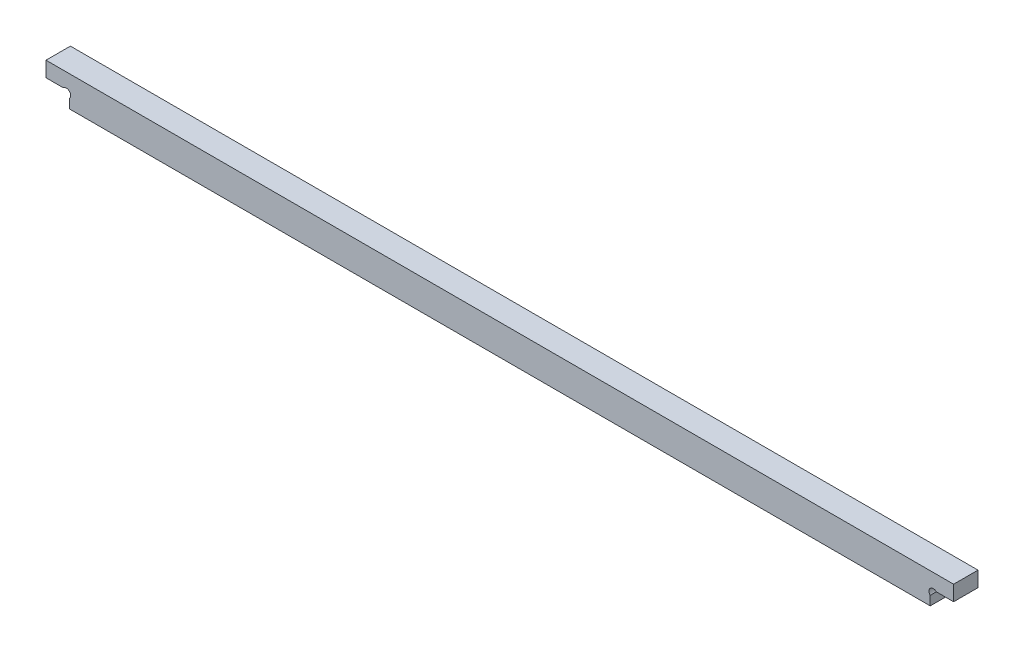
ISO-10303-21;
HEADER;
FILE_DESCRIPTION(('STEP AP214'),'2;1');
FILE_NAME('part.step','',(''),(''),'','','');
FILE_SCHEMA(('AUTOMOTIVE_DESIGN { 1 0 10303 214 1 1 1 1 }'));
ENDSEC;
DATA;
#1=APPLICATION_CONTEXT('core data for automotive mechanical design processes');
#2=APPLICATION_PROTOCOL_DEFINITION('international standard','automotive_design',2000,#1);
#3=PRODUCT_CONTEXT('',#1,'mechanical');
#4=PRODUCT('Part','Part','',(#3));
#5=PRODUCT_RELATED_PRODUCT_CATEGORY('part','',(#4));
#6=PRODUCT_DEFINITION_FORMATION('','',#4);
#7=PRODUCT_DEFINITION_CONTEXT('part definition',#1,'design');
#8=PRODUCT_DEFINITION('design','',#6,#7);
#9=PRODUCT_DEFINITION_SHAPE('','',#8);
#10=(LENGTH_UNIT() NAMED_UNIT(*) SI_UNIT(.MILLI.,.METRE.));
#11=(NAMED_UNIT(*) PLANE_ANGLE_UNIT() SI_UNIT($,.RADIAN.));
#12=(NAMED_UNIT(*) SI_UNIT($,.STERADIAN.) SOLID_ANGLE_UNIT());
#13=UNCERTAINTY_MEASURE_WITH_UNIT(LENGTH_MEASURE(1.E-05),#10,'distance_accuracy_value','');
#14=(GEOMETRIC_REPRESENTATION_CONTEXT(3) GLOBAL_UNCERTAINTY_ASSIGNED_CONTEXT((#13)) GLOBAL_UNIT_ASSIGNED_CONTEXT((#10,
#11,#12)) REPRESENTATION_CONTEXT('',''));
#15=CARTESIAN_POINT('',(0.,0.,0.));
#16=DIRECTION('',(0.,0.,1.));
#17=DIRECTION('',(1.,0.,0.));
#18=AXIS2_PLACEMENT_3D('',#15,#16,#17);
#19=CARTESIAN_POINT('',(-446.5,15.0000000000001,24.));
#20=DIRECTION('',(1.,0.,0.));
#21=DIRECTION('',(0.,0.,-1.));
#22=AXIS2_PLACEMENT_3D('',#19,#20,#21);
#23=PLANE('',#22);
#24=DIRECTION('',(0.,-1.,0.));
#25=VECTOR('',#24,1.);
#26=CARTESIAN_POINT('',(-446.5,15.0000000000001,0.));
#27=LINE('',#26,#25);
#28=CARTESIAN_POINT('',(-446.5,15.0000000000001,0.));
#29=VERTEX_POINT('',#28);
#30=CARTESIAN_POINT('',(-446.5,0.,0.));
#31=VERTEX_POINT('',#30);
#32=EDGE_CURVE('E139',#29,#31,#27,.T.);
#33=ORIENTED_EDGE('',*,*,#32,.T.);
#34=DIRECTION('',(0.,0.,1.));
#35=VECTOR('',#34,1.);
#36=CARTESIAN_POINT('',(-446.5,0.,0.));
#37=LINE('',#36,#35);
#38=CARTESIAN_POINT('',(-446.5,0.,24.));
#39=VERTEX_POINT('',#38);
#40=EDGE_CURVE('E149',#31,#39,#37,.T.);
#41=ORIENTED_EDGE('',*,*,#40,.T.);
#42=DIRECTION('',(0.,-1.,0.));
#43=VECTOR('',#42,1.);
#44=CARTESIAN_POINT('',(-446.5,15.0000000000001,24.));
#45=LINE('',#44,#43);
#46=CARTESIAN_POINT('',(-446.5,15.0000000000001,24.));
#47=VERTEX_POINT('',#46);
#48=EDGE_CURVE('E153',#47,#39,#45,.T.);
#49=ORIENTED_EDGE('',*,*,#48,.F.);
#50=DIRECTION('',(0.,0.,-1.));
#51=VECTOR('',#50,1.);
#52=CARTESIAN_POINT('',(-446.5,15.0000000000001,24.));
#53=LINE('',#52,#51);
#54=EDGE_CURVE('E45',#47,#29,#53,.T.);
#55=ORIENTED_EDGE('',*,*,#54,.T.);
#56=EDGE_LOOP('',(#33,#41,#49,#55));
#57=FACE_BOUND('',#56,.T.);
#58=ADVANCED_FACE('F38',(#57),#23,.F.);
#59=CARTESIAN_POINT('',(-446.5,-15.0000000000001,24.));
#60=DIRECTION('',(0.,1.,0.));
#61=DIRECTION('',(0.,0.,1.));
#62=AXIS2_PLACEMENT_3D('',#59,#60,#61);
#63=PLANE('',#62);
#64=DIRECTION('',(1.,0.,0.));
#65=VECTOR('',#64,1.);
#66=CARTESIAN_POINT('',(-446.5,-15.0000000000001,24.));
#67=LINE('',#66,#65);
#68=CARTESIAN_POINT('',(-423.5,-15.0000000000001,24.));
#69=VERTEX_POINT('',#68);
#70=CARTESIAN_POINT('',(423.5,-15.,24.));
#71=VERTEX_POINT('',#70);
#72=EDGE_CURVE('E131',#69,#71,#67,.T.);
#73=ORIENTED_EDGE('',*,*,#72,.F.);
#74=DIRECTION('',(0.,0.,1.));
#75=VECTOR('',#74,1.);
#76=CARTESIAN_POINT('',(-423.5,-15.0000000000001,0.));
#77=LINE('',#76,#75);
#78=CARTESIAN_POINT('',(-423.5,-15.0000000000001,0.));
#79=VERTEX_POINT('',#78);
#80=EDGE_CURVE('E118',#79,#69,#77,.T.);
#81=ORIENTED_EDGE('',*,*,#80,.F.);
#82=DIRECTION('',(1.,0.,0.));
#83=VECTOR('',#82,1.);
#84=CARTESIAN_POINT('',(-446.5,-15.0000000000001,0.));
#85=LINE('',#84,#83);
#86=CARTESIAN_POINT('',(423.5,-15.0000000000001,0.));
#87=VERTEX_POINT('',#86);
#88=EDGE_CURVE('E129',#79,#87,#85,.T.);
#89=ORIENTED_EDGE('',*,*,#88,.T.);
#90=DIRECTION('',(0.,0.,1.));
#91=VECTOR('',#90,1.);
#92=CARTESIAN_POINT('',(423.5,-15.,0.));
#93=LINE('',#92,#91);
#94=EDGE_CURVE('E60',#87,#71,#93,.T.);
#95=ORIENTED_EDGE('',*,*,#94,.T.);
#96=EDGE_LOOP('',(#73,#81,#89,#95));
#97=FACE_BOUND('',#96,.T.);
#98=ADVANCED_FACE('F128',(#97),#63,.F.);
#99=CARTESIAN_POINT('',(446.5,15.0000000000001,24.));
#100=DIRECTION('',(-1.,0.,0.));
#101=DIRECTION('',(0.,0.,1.));
#102=AXIS2_PLACEMENT_3D('',#99,#100,#101);
#103=PLANE('',#102);
#104=DIRECTION('',(0.,1.,0.));
#105=VECTOR('',#104,1.);
#106=CARTESIAN_POINT('',(446.5,15.0000000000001,24.));
#107=LINE('',#106,#105);
#108=CARTESIAN_POINT('',(446.5,1.09360959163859E-13,24.));
#109=VERTEX_POINT('',#108);
#110=CARTESIAN_POINT('',(446.5,15.0000000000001,24.));
#111=VERTEX_POINT('',#110);
#112=EDGE_CURVE('E164',#109,#111,#107,.T.);
#113=ORIENTED_EDGE('',*,*,#112,.F.);
#114=DIRECTION('',(0.,0.,1.));
#115=VECTOR('',#114,1.);
#116=CARTESIAN_POINT('',(446.5,1.09360959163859E-13,0.));
#117=LINE('',#116,#115);
#118=CARTESIAN_POINT('',(446.5,1.09360959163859E-13,0.));
#119=VERTEX_POINT('',#118);
#120=EDGE_CURVE('E178',#119,#109,#117,.T.);
#121=ORIENTED_EDGE('',*,*,#120,.F.);
#122=DIRECTION('',(0.,1.,0.));
#123=VECTOR('',#122,1.);
#124=CARTESIAN_POINT('',(446.5,15.0000000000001,0.));
#125=LINE('',#124,#123);
#126=CARTESIAN_POINT('',(446.5,15.0000000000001,0.));
#127=VERTEX_POINT('',#126);
#128=EDGE_CURVE('E138',#119,#127,#125,.T.);
#129=ORIENTED_EDGE('',*,*,#128,.T.);
#130=DIRECTION('',(0.,0.,-1.));
#131=VECTOR('',#130,1.);
#132=CARTESIAN_POINT('',(446.5,15.0000000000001,24.));
#133=LINE('',#132,#131);
#134=EDGE_CURVE('E11',#111,#127,#133,.T.);
#135=ORIENTED_EDGE('',*,*,#134,.F.);
#136=EDGE_LOOP('',(#113,#121,#129,#135));
#137=FACE_BOUND('',#136,.T.);
#138=ADVANCED_FACE('F229',(#137),#103,.F.);
#139=CARTESIAN_POINT('',(-446.5,15.0000000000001,24.));
#140=DIRECTION('',(0.,-1.,0.));
#141=DIRECTION('',(0.,0.,-1.));
#142=AXIS2_PLACEMENT_3D('',#139,#140,#141);
#143=PLANE('',#142);
#144=DIRECTION('',(-1.,0.,0.));
#145=VECTOR('',#144,1.);
#146=CARTESIAN_POINT('',(-446.5,15.0000000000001,0.));
#147=LINE('',#146,#145);
#148=EDGE_CURVE('E145',#127,#29,#147,.T.);
#149=ORIENTED_EDGE('',*,*,#148,.T.);
#150=ORIENTED_EDGE('',*,*,#54,.F.);
#151=DIRECTION('',(-1.,0.,0.));
#152=VECTOR('',#151,1.);
#153=CARTESIAN_POINT('',(-446.5,15.0000000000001,24.));
#154=LINE('',#153,#152);
#155=EDGE_CURVE('E156',#111,#47,#154,.T.);
#156=ORIENTED_EDGE('',*,*,#155,.F.);
#157=ORIENTED_EDGE('',*,*,#134,.T.);
#158=EDGE_LOOP('',(#149,#150,#156,#157));
#159=FACE_BOUND('',#158,.T.);
#160=ADVANCED_FACE('F232',(#159),#143,.F.);
#161=CARTESIAN_POINT('',(0.,0.,24.));
#162=DIRECTION('',(0.,0.,1.));
#163=DIRECTION('',(1.,0.,0.));
#164=AXIS2_PLACEMENT_3D('',#161,#162,#163);
#165=PLANE('',#164);
#166=DIRECTION('',(-1.,0.,0.));
#167=VECTOR('',#166,1.);
#168=CARTESIAN_POINT('',(-446.5,0.,24.));
#169=LINE('',#168,#167);
#170=CARTESIAN_POINT('',(-429.510398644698,0.,24.));
#171=VERTEX_POINT('',#170);
#172=EDGE_CURVE('E123',#171,#39,#169,.T.);
#173=ORIENTED_EDGE('',*,*,#172,.F.);
#174=CARTESIAN_POINT('',(-426.5,-3.,24.));
#175=DIRECTION('',(0.,0.,1.));
#176=DIRECTION('',(1.,0.,0.));
#177=AXIS2_PLACEMENT_3D('',#174,#175,#176);
#178=CIRCLE('',#177,4.25000000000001);
#179=CARTESIAN_POINT('',(-423.5,-6.01039864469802,24.));
#180=VERTEX_POINT('',#179);
#181=EDGE_CURVE('E202',#180,#171,#178,.T.);
#182=ORIENTED_EDGE('',*,*,#181,.F.);
#183=DIRECTION('',(0.,1.,0.));
#184=VECTOR('',#183,1.);
#185=CARTESIAN_POINT('',(-423.5,-15.0000000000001,24.));
#186=LINE('',#185,#184);
#187=EDGE_CURVE('E182',#69,#180,#186,.T.);
#188=ORIENTED_EDGE('',*,*,#187,.F.);
#189=ORIENTED_EDGE('',*,*,#72,.T.);
#190=DIRECTION('',(0.,-1.,0.));
#191=VECTOR('',#190,1.);
#192=CARTESIAN_POINT('',(423.5,-15.,24.));
#193=LINE('',#192,#191);
#194=CARTESIAN_POINT('',(423.5,-6.01039864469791,24.));
#195=VERTEX_POINT('',#194);
#196=EDGE_CURVE('E187',#195,#71,#193,.T.);
#197=ORIENTED_EDGE('',*,*,#196,.F.);
#198=CARTESIAN_POINT('',(426.5,-2.9999999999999,24.));
#199=DIRECTION('',(0.,0.,1.));
#200=DIRECTION('',(-1.,0.,0.));
#201=AXIS2_PLACEMENT_3D('',#198,#199,#200);
#202=CIRCLE('',#201,4.25000000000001);
#203=CARTESIAN_POINT('',(429.510398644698,1.05199706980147E-13,24.));
#204=VERTEX_POINT('',#203);
#205=EDGE_CURVE('E189',#204,#195,#202,.T.);
#206=ORIENTED_EDGE('',*,*,#205,.F.);
#207=DIRECTION('',(-1.,0.,0.));
#208=VECTOR('',#207,1.);
#209=CARTESIAN_POINT('',(446.5,1.09360959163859E-13,24.));
#210=LINE('',#209,#208);
#211=EDGE_CURVE('E183',#109,#204,#210,.T.);
#212=ORIENTED_EDGE('',*,*,#211,.F.);
#213=ORIENTED_EDGE('',*,*,#112,.T.);
#214=ORIENTED_EDGE('',*,*,#155,.T.);
#215=ORIENTED_EDGE('',*,*,#48,.T.);
#216=EDGE_LOOP('',(#173,#182,#188,#189,#197,#206,#212,#213,#214,#215));
#217=FACE_BOUND('',#216,.T.);
#218=ADVANCED_FACE('F212',(#217),#165,.T.);
#219=CARTESIAN_POINT('',(0.,0.,0.));
#220=DIRECTION('',(0.,0.,1.));
#221=DIRECTION('',(1.,0.,0.));
#222=AXIS2_PLACEMENT_3D('',#219,#220,#221);
#223=PLANE('',#222);
#224=CARTESIAN_POINT('',(-426.5,-3.,0.));
#225=DIRECTION('',(0.,0.,1.));
#226=DIRECTION('',(1.,0.,0.));
#227=AXIS2_PLACEMENT_3D('',#224,#225,#226);
#228=CIRCLE('',#227,4.25000000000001);
#229=CARTESIAN_POINT('',(-423.5,-6.01039864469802,0.));
#230=VERTEX_POINT('',#229);
#231=CARTESIAN_POINT('',(-429.510398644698,0.,0.));
#232=VERTEX_POINT('',#231);
#233=EDGE_CURVE('E52',#230,#232,#228,.T.);
#234=ORIENTED_EDGE('',*,*,#233,.T.);
#235=DIRECTION('',(-1.,0.,0.));
#236=VECTOR('',#235,1.);
#237=CARTESIAN_POINT('',(-446.5,0.,0.));
#238=LINE('',#237,#236);
#239=EDGE_CURVE('E132',#232,#31,#238,.T.);
#240=ORIENTED_EDGE('',*,*,#239,.T.);
#241=ORIENTED_EDGE('',*,*,#32,.F.);
#242=ORIENTED_EDGE('',*,*,#148,.F.);
#243=ORIENTED_EDGE('',*,*,#128,.F.);
#244=DIRECTION('',(-1.,0.,0.));
#245=VECTOR('',#244,1.);
#246=CARTESIAN_POINT('',(446.5,1.09360959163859E-13,0.));
#247=LINE('',#246,#245);
#248=CARTESIAN_POINT('',(429.510398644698,1.05199706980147E-13,0.));
#249=VERTEX_POINT('',#248);
#250=EDGE_CURVE('E176',#119,#249,#247,.T.);
#251=ORIENTED_EDGE('',*,*,#250,.T.);
#252=CARTESIAN_POINT('',(426.5,-2.9999999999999,0.));
#253=DIRECTION('',(0.,0.,1.));
#254=DIRECTION('',(-1.,0.,0.));
#255=AXIS2_PLACEMENT_3D('',#252,#253,#254);
#256=CIRCLE('',#255,4.25000000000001);
#257=CARTESIAN_POINT('',(423.5,-6.01039864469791,0.));
#258=VERTEX_POINT('',#257);
#259=EDGE_CURVE('E186',#249,#258,#256,.T.);
#260=ORIENTED_EDGE('',*,*,#259,.T.);
#261=DIRECTION('',(0.,-1.,0.));
#262=VECTOR('',#261,1.);
#263=CARTESIAN_POINT('',(423.5,-15.,0.));
#264=LINE('',#263,#262);
#265=EDGE_CURVE('E136',#258,#87,#264,.T.);
#266=ORIENTED_EDGE('',*,*,#265,.T.);
#267=ORIENTED_EDGE('',*,*,#88,.F.);
#268=DIRECTION('',(0.,1.,0.));
#269=VECTOR('',#268,1.);
#270=CARTESIAN_POINT('',(-423.5,-15.0000000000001,0.));
#271=LINE('',#270,#269);
#272=EDGE_CURVE('E114',#79,#230,#271,.T.);
#273=ORIENTED_EDGE('',*,*,#272,.T.);
#274=EDGE_LOOP('',(#234,#240,#241,#242,#243,#251,#260,#266,#267,#273));
#275=FACE_BOUND('',#274,.T.);
#276=ADVANCED_FACE('F134',(#275),#223,.F.);
#277=CARTESIAN_POINT('',(426.5,-2.9999999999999,0.));
#278=DIRECTION('',(0.,0.,1.));
#279=DIRECTION('',(1.,0.,0.));
#280=AXIS2_PLACEMENT_3D('',#277,#278,#279);
#281=CYLINDRICAL_SURFACE('',#280,4.25000000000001);
#282=ORIENTED_EDGE('',*,*,#205,.T.);
#283=DIRECTION('',(0.,0.,1.));
#284=VECTOR('',#283,1.);
#285=CARTESIAN_POINT('',(423.5,-6.01039864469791,0.));
#286=LINE('',#285,#284);
#287=EDGE_CURVE('E174',#258,#195,#286,.T.);
#288=ORIENTED_EDGE('',*,*,#287,.F.);
#289=ORIENTED_EDGE('',*,*,#259,.F.);
#290=DIRECTION('',(0.,0.,1.));
#291=VECTOR('',#290,1.);
#292=CARTESIAN_POINT('',(429.510398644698,1.05199706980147E-13,0.));
#293=LINE('',#292,#291);
#294=EDGE_CURVE('E180',#249,#204,#293,.T.);
#295=ORIENTED_EDGE('',*,*,#294,.T.);
#296=EDGE_LOOP('',(#282,#288,#289,#295));
#297=FACE_BOUND('',#296,.T.);
#298=ADVANCED_FACE('F222',(#297),#281,.F.);
#299=CARTESIAN_POINT('',(446.5,1.09360959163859E-13,0.));
#300=DIRECTION('',(0.,1.,0.));
#301=DIRECTION('',(-1.,0.,0.));
#302=AXIS2_PLACEMENT_3D('',#299,#300,#301);
#303=PLANE('',#302);
#304=ORIENTED_EDGE('',*,*,#211,.T.);
#305=ORIENTED_EDGE('',*,*,#294,.F.);
#306=ORIENTED_EDGE('',*,*,#250,.F.);
#307=ORIENTED_EDGE('',*,*,#120,.T.);
#308=EDGE_LOOP('',(#304,#305,#306,#307));
#309=FACE_BOUND('',#308,.T.);
#310=ADVANCED_FACE('F224',(#309),#303,.F.);
#311=CARTESIAN_POINT('',(423.5,-15.,0.));
#312=DIRECTION('',(-1.,0.,0.));
#313=DIRECTION('',(0.,-1.,0.));
#314=AXIS2_PLACEMENT_3D('',#311,#312,#313);
#315=PLANE('',#314);
#316=ORIENTED_EDGE('',*,*,#196,.T.);
#317=ORIENTED_EDGE('',*,*,#94,.F.);
#318=ORIENTED_EDGE('',*,*,#265,.F.);
#319=ORIENTED_EDGE('',*,*,#287,.T.);
#320=EDGE_LOOP('',(#316,#317,#318,#319));
#321=FACE_BOUND('',#320,.T.);
#322=ADVANCED_FACE('F219',(#321),#315,.F.);
#323=CARTESIAN_POINT('',(-446.5,0.,0.));
#324=DIRECTION('',(0.,1.,0.));
#325=DIRECTION('',(0.,0.,1.));
#326=AXIS2_PLACEMENT_3D('',#323,#324,#325);
#327=PLANE('',#326);
#328=ORIENTED_EDGE('',*,*,#172,.T.);
#329=ORIENTED_EDGE('',*,*,#40,.F.);
#330=ORIENTED_EDGE('',*,*,#239,.F.);
#331=DIRECTION('',(0.,0.,1.));
#332=VECTOR('',#331,1.);
#333=CARTESIAN_POINT('',(-429.510398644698,0.,0.));
#334=LINE('',#333,#332);
#335=EDGE_CURVE('E197',#232,#171,#334,.T.);
#336=ORIENTED_EDGE('',*,*,#335,.T.);
#337=EDGE_LOOP('',(#328,#329,#330,#336));
#338=FACE_BOUND('',#337,.T.);
#339=ADVANCED_FACE('F214',(#338),#327,.F.);
#340=CARTESIAN_POINT('',(-426.5,-3.,0.));
#341=DIRECTION('',(0.,0.,1.));
#342=DIRECTION('',(1.,0.,0.));
#343=AXIS2_PLACEMENT_3D('',#340,#341,#342);
#344=CYLINDRICAL_SURFACE('',#343,4.25000000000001);
#345=ORIENTED_EDGE('',*,*,#181,.T.);
#346=ORIENTED_EDGE('',*,*,#335,.F.);
#347=ORIENTED_EDGE('',*,*,#233,.F.);
#348=DIRECTION('',(0.,0.,1.));
#349=VECTOR('',#348,1.);
#350=CARTESIAN_POINT('',(-423.5,-6.01039864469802,0.));
#351=LINE('',#350,#349);
#352=EDGE_CURVE('E120',#230,#180,#351,.T.);
#353=ORIENTED_EDGE('',*,*,#352,.T.);
#354=EDGE_LOOP('',(#345,#346,#347,#353));
#355=FACE_BOUND('',#354,.T.);
#356=ADVANCED_FACE('F215',(#355),#344,.F.);
#357=CARTESIAN_POINT('',(-423.5,-15.0000000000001,0.));
#358=DIRECTION('',(1.,0.,0.));
#359=DIRECTION('',(0.,1.,0.));
#360=AXIS2_PLACEMENT_3D('',#357,#358,#359);
#361=PLANE('',#360);
#362=ORIENTED_EDGE('',*,*,#187,.T.);
#363=ORIENTED_EDGE('',*,*,#352,.F.);
#364=ORIENTED_EDGE('',*,*,#272,.F.);
#365=ORIENTED_EDGE('',*,*,#80,.T.);
#366=EDGE_LOOP('',(#362,#363,#364,#365));
#367=FACE_BOUND('',#366,.T.);
#368=ADVANCED_FACE('F117',(#367),#361,.F.);
#369=CLOSED_SHELL('',(#58,#98,#138,#160,#218,#276,#298,#310,#322,#339,#356,#368));
#370=MANIFOLD_SOLID_BREP('B2',#369);
#371=ADVANCED_BREP_SHAPE_REPRESENTATION('',(#18,#370),#14);
#372=SHAPE_DEFINITION_REPRESENTATION(#9,#371);
ENDSEC;
END-ISO-10303-21;
